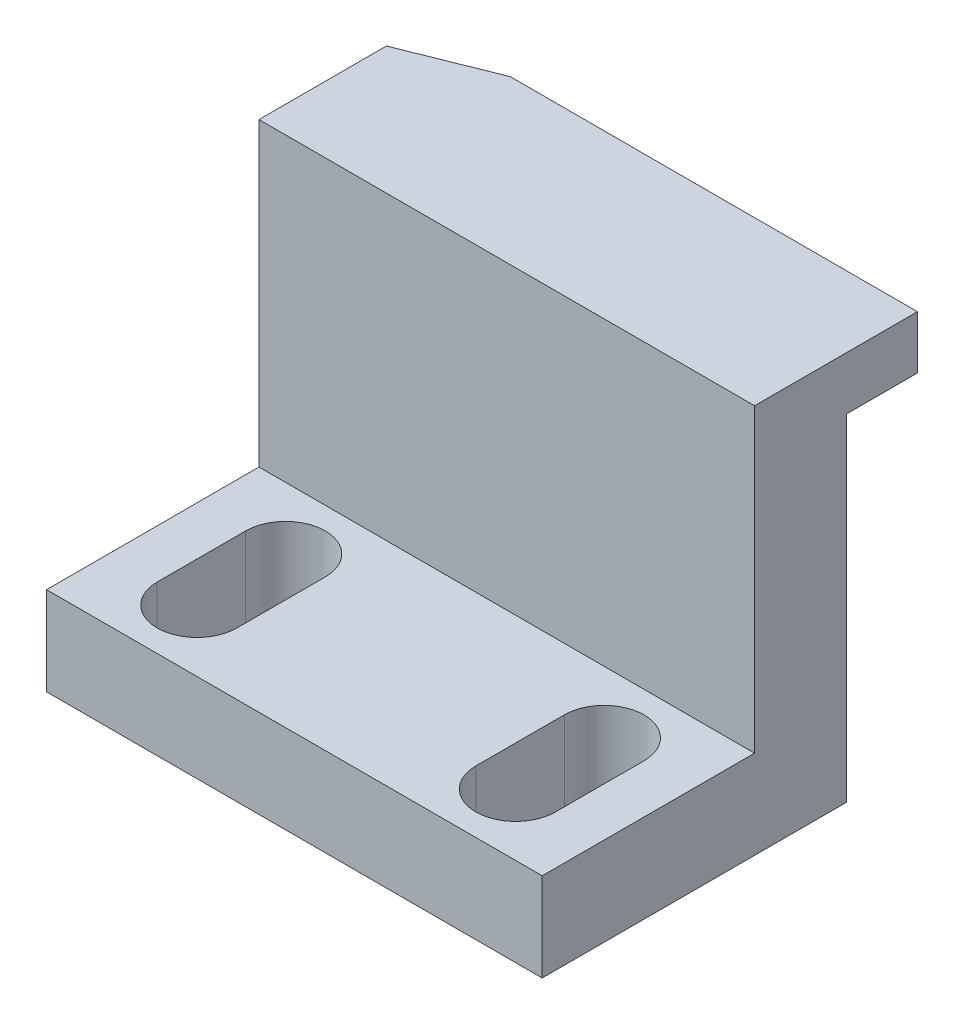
from build123d import *

# Parameters (mm, degrees)
SKETCH_1_W          = 28
SKETCH_1_H          = 22
EXTRUDE_1_DEPTH     = 21.2
SKETCH_2_OUTSIDE_W  = 31.488
SKETCH_2_OUTSIDE_H  = 32.288
CUT_EXTRUDE_1_DEPTH = 42.442007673
SKETCH_3_OUTSIDE_W  = 38.288
SKETCH_3_OUTSIDE_H  = 31.488
CUT_EXTRUDE_2_DEPTH = 42.442007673


with BuildPart() as part:
    # Sketch 1 → Extrude 1 (new body)
    with BuildSketch(Plane.XY):
        with Locations((14, 11)):
            Rectangle(SKETCH_1_W, SKETCH_1_H)
    extrude(amount=EXTRUDE_1_DEPTH)

    # Sketch 2 outside → Cut-Extrude 1 (cut, through all)
    with BuildSketch(Plane(origin=(28, 0, 0), x_dir=(0, 0, -1), z_dir=(1, 0, 0))):
        with Locations((-10.6, 11)):
            Rectangle(SKETCH_2_OUTSIDE_W, SKETCH_2_OUTSIDE_H)
        Polygon((-21.2, 0), (-21.2, 5), (-9.2, 5), (-9.2, 22), (0, 22), (0, 19), (-4, 19), (-4, 0), align=None, mode=Mode.SUBTRACT)
    extrude(amount=-CUT_EXTRUDE_1_DEPTH, mode=Mode.SUBTRACT)

    # Sketch 3 outside → Cut-Extrude 2 (cut, through all)
    # profile 1 of 3: a face of its own
    with BuildSketch(Plane(origin=(0, 22, 0), x_dir=(1, 0, 0), z_dir=(0, 1, 0))):
        with Locations((14, -10.6)):
            Rectangle(SKETCH_3_OUTSIDE_W, SKETCH_3_OUTSIDE_H)
        Polygon((0, -21.2), (28, -21.2), (28, 0), (5, 0), (0, -2), align=None, mode=Mode.SUBTRACT)
    # profile 2 of 3: a face of its own
    with BuildSketch(Plane(origin=(0, 22, 0), x_dir=(1, 0, 0), z_dir=(0, 1, 0))):
        with BuildLine():
            Line((25.25, -17.7), (25.25, -12.7))
            ThreePointArc((25.25, -12.7), (23, -10.45), (20.75, -12.7))
            Line((20.75, -12.7), (20.75, -17.7))
            ThreePointArc((20.75, -17.7), (23, -19.95), (25.25, -17.7))
        make_face()
    # profile 3 of 3: a face of its own
    with BuildSketch(Plane(origin=(0, 22, 0), x_dir=(1, 0, 0), z_dir=(0, 1, 0))):
        with BuildLine():
            Line((7.25, -17.7), (7.25, -12.7))
            ThreePointArc((7.25, -12.7), (5, -10.45), (2.75, -12.7))
            Line((2.75, -12.7), (2.75, -17.7))
            ThreePointArc((2.75, -17.7), (5, -19.95), (7.25, -17.7))
        make_face()
    extrude(amount=-CUT_EXTRUDE_2_DEPTH, mode=Mode.SUBTRACT)


solid = part.part
